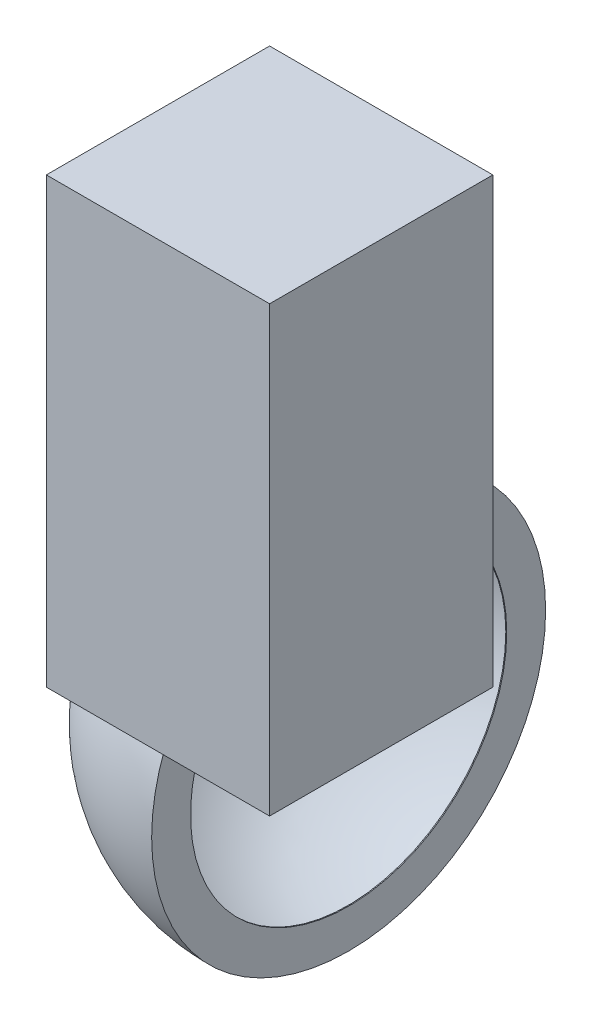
from build123d import *

# Parameters (mm, degrees)
SKETCH2_W           = 353
SKETCH2_H           = 353
SKETCH2_W_2         = 350
SKETCH2_H_2         = 350
EXTRUDE_THIN1_DEPTH = 700
SKETCH3_W           = 353
SKETCH3_H           = 353
EXTRUDE1_DEPTH      = 1.5


with BuildPart() as part:
    # Sketch1 → Revolve-Thin1 (revolve)
    with BuildSketch(Plane.XY):
        with BuildLine():
            Line((-326.5, 250), (-326.5, 310))
            ThreePointArc((-326.5, 310), (-545.703102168, 219.203102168), (-636.5, 0))
            Line((-636.5, 0), (-638, 0))
            ThreePointArc((-638, 0), (-546.232792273, 220.793455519), (-325, 311.496388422))
            Line((-325, 311.496388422), (-325, 250))
            Line((-325, 250), (-326.5, 250))
        make_face()
    revolve(axis=Axis((0, 0, 0), (-1, 0, 0)))


with BuildPart() as body_2:
    # Sketch2 → Extrude-Thin1 (new body)
    with BuildSketch(Plane(origin=(0, 312.5, 0), x_dir=(1, 0, 0), z_dir=(0, 1, 0))):
        with Locations((-125, -325)):
            Rectangle(SKETCH2_W, SKETCH2_H)
        with Locations((-125, -325)):
            Rectangle(SKETCH2_W_2, SKETCH2_H_2, mode=Mode.SUBTRACT)
    extrude(amount=EXTRUDE_THIN1_DEPTH)

    # Sketch3 → Extrude1 (add)
    with BuildSketch(Plane(origin=(0, 1012.5, 0), x_dir=(1, 0, 0), z_dir=(0, 1, 0))):
        with Locations((-125, -325)):
            Rectangle(SKETCH3_W, SKETCH3_H)
    extrude(amount=EXTRUDE1_DEPTH)


solid = Compound([part.part, body_2.part])
